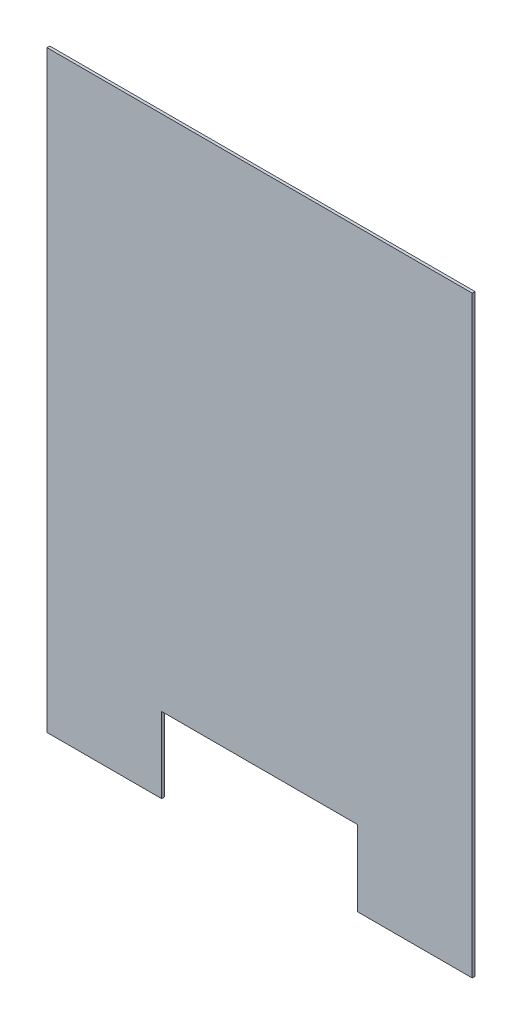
from build123d import *

# Parameters (mm, degrees)
INSULATOR_ASSUMED_T0_2_START        = 5.6
INSULATOR_ASSUMED_T0_2_SKETCH_W     = 30.4
INSULATOR_ASSUMED_T0_2_SKETCH_H     = 42.4
INSULATOR_ASSUMED_T0_2_DEPTH        = 0.2
FPC_CONNECTOR_SHEET_RELIEF_START    = 5.59
FPC_CONNECTOR_SHEET_RELIEF_SKETCH_W = 14
FPC_CONNECTOR_SHEET_RELIEF_SKETCH_H = 6.4
FPC_CONNECTOR_SHEET_RELIEF_DEPTH    = 0.22


with BuildPart() as part:
    # Insulator_ASSUMED_T0_2_Sketch → Insulator_ASSUMED_T0_2 (new body)
    with BuildSketch(Plane.XY.offset(INSULATOR_ASSUMED_T0_2_START)):
        Rectangle(INSULATOR_ASSUMED_T0_2_SKETCH_W, INSULATOR_ASSUMED_T0_2_SKETCH_H)
    extrude(amount=INSULATOR_ASSUMED_T0_2_DEPTH)

    # FPC_connector_sheet_relief_Sketch → FPC_connector_sheet_relief (cut)
    with BuildSketch(Plane.XY.offset(FPC_CONNECTOR_SHEET_RELIEF_START)):
        with Locations((0, -19)):
            Rectangle(FPC_CONNECTOR_SHEET_RELIEF_SKETCH_W, FPC_CONNECTOR_SHEET_RELIEF_SKETCH_H)
    extrude(amount=FPC_CONNECTOR_SHEET_RELIEF_DEPTH, mode=Mode.SUBTRACT)


solid = part.part
